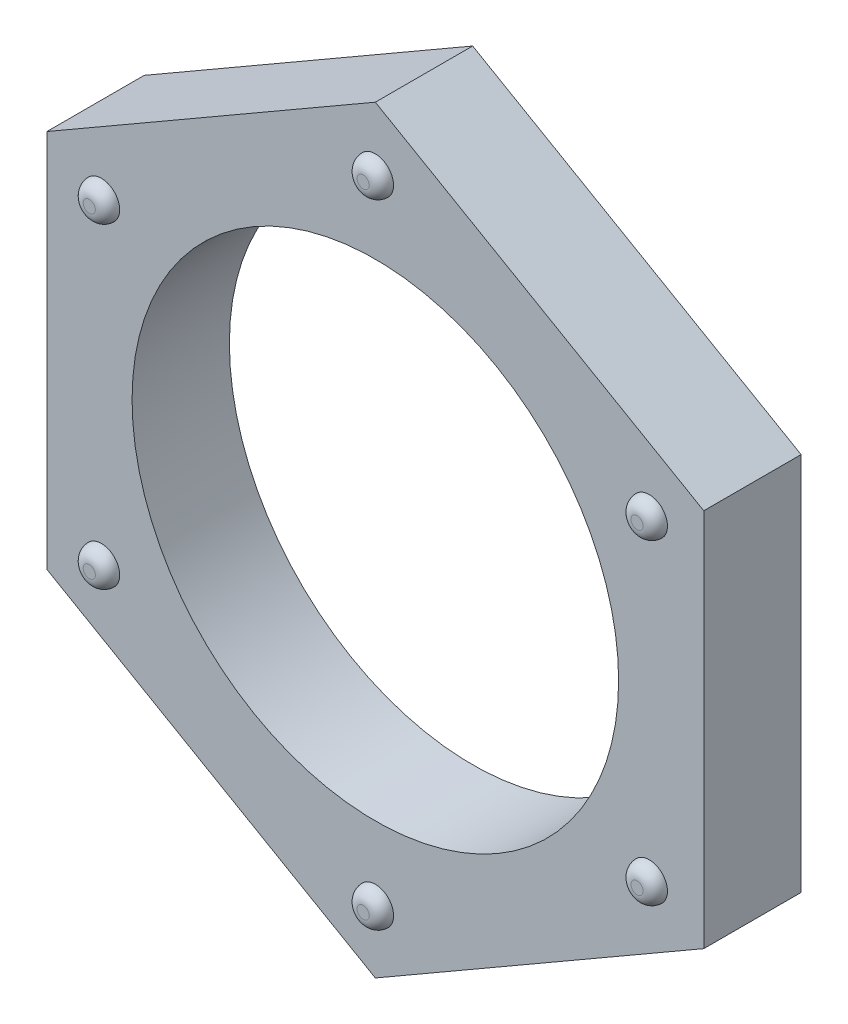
ISO-10303-21;
HEADER;
FILE_DESCRIPTION(('STEP AP214'),'2;1');
FILE_NAME('part.step','',(''),(''),'','','');
FILE_SCHEMA(('AUTOMOTIVE_DESIGN { 1 0 10303 214 1 1 1 1 }'));
ENDSEC;
DATA;
#1=APPLICATION_CONTEXT('core data for automotive mechanical design processes');
#2=APPLICATION_PROTOCOL_DEFINITION('international standard','automotive_design',2000,#1);
#3=PRODUCT_CONTEXT('',#1,'mechanical');
#4=PRODUCT('Part','Part','',(#3));
#5=PRODUCT_RELATED_PRODUCT_CATEGORY('part','',(#4));
#6=PRODUCT_DEFINITION_FORMATION('','',#4);
#7=PRODUCT_DEFINITION_CONTEXT('part definition',#1,'design');
#8=PRODUCT_DEFINITION('design','',#6,#7);
#9=PRODUCT_DEFINITION_SHAPE('','',#8);
#10=(LENGTH_UNIT() NAMED_UNIT(*) SI_UNIT(.MILLI.,.METRE.));
#11=(NAMED_UNIT(*) PLANE_ANGLE_UNIT() SI_UNIT($,.RADIAN.));
#12=(NAMED_UNIT(*) SI_UNIT($,.STERADIAN.) SOLID_ANGLE_UNIT());
#13=UNCERTAINTY_MEASURE_WITH_UNIT(LENGTH_MEASURE(1.E-05),#10,'distance_accuracy_value','');
#14=(GEOMETRIC_REPRESENTATION_CONTEXT(3) GLOBAL_UNCERTAINTY_ASSIGNED_CONTEXT((#13)) GLOBAL_UNIT_ASSIGNED_CONTEXT((#10,
#11,#12)) REPRESENTATION_CONTEXT('',''));
#15=CARTESIAN_POINT('',(0.,0.,0.));
#16=DIRECTION('',(0.,0.,1.));
#17=DIRECTION('',(1.,0.,0.));
#18=AXIS2_PLACEMENT_3D('',#15,#16,#17);
#19=CARTESIAN_POINT('',(0.,15.58845726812,4.));
#20=DIRECTION('',(0.,0.,-1.));
#21=DIRECTION('',(-1.,0.,0.));
#22=AXIS2_PLACEMENT_3D('',#19,#20,#21);
#23=PLANE('',#22);
#24=CARTESIAN_POINT('',(-11.2583302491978,-6.4999999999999,4.));
#25=DIRECTION('',(0.,0.,-1.));
#26=DIRECTION('',(-1.,0.,0.));
#27=AXIS2_PLACEMENT_3D('',#24,#25,#26);
#28=CIRCLE('',#27,0.75);
#29=CARTESIAN_POINT('',(-12.0083302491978,-6.4999999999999,4.));
#30=VERTEX_POINT('',#29);
#31=EDGE_CURVE('E137',#30,#30,#28,.F.);
#32=ORIENTED_EDGE('',*,*,#31,.F.);
#33=EDGE_LOOP('',(#32));
#34=FACE_BOUND('',#33,.T.);
#35=CARTESIAN_POINT('',(11.2583302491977,-6.5,4.));
#36=DIRECTION('',(0.,0.,-1.));
#37=DIRECTION('',(-1.,0.,0.));
#38=AXIS2_PLACEMENT_3D('',#35,#36,#37);
#39=CIRCLE('',#38,0.75);
#40=CARTESIAN_POINT('',(10.5083302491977,-6.5,4.));
#41=VERTEX_POINT('',#40);
#42=EDGE_CURVE('E131',#41,#41,#39,.F.);
#43=ORIENTED_EDGE('',*,*,#42,.F.);
#44=EDGE_LOOP('',(#43));
#45=FACE_BOUND('',#44,.T.);
#46=CARTESIAN_POINT('',(0.,13.,4.));
#47=DIRECTION('',(0.,0.,1.));
#48=DIRECTION('',(1.,0.,0.));
#49=AXIS2_PLACEMENT_3D('',#46,#47,#48);
#50=CIRCLE('',#49,0.75);
#51=CARTESIAN_POINT('',(0.75,13.,4.));
#52=VERTEX_POINT('',#51);
#53=EDGE_CURVE('E78',#52,#52,#50,.T.);
#54=ORIENTED_EDGE('',*,*,#53,.F.);
#55=EDGE_LOOP('',(#54));
#56=FACE_BOUND('',#55,.T.);
#57=DIRECTION('',(-0.866025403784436,0.5,0.));
#58=VECTOR('',#57,1.);
#59=CARTESIAN_POINT('',(13.5,7.79422863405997,4.));
#60=LINE('',#59,#58);
#61=CARTESIAN_POINT('',(13.5,7.79422863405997,4.));
#62=VERTEX_POINT('',#61);
#63=CARTESIAN_POINT('',(0.,15.58845726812,4.));
#64=VERTEX_POINT('',#63);
#65=EDGE_CURVE('E105',#62,#64,#60,.T.);
#66=ORIENTED_EDGE('',*,*,#65,.T.);
#67=DIRECTION('',(0.866025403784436,0.5,0.));
#68=VECTOR('',#67,1.);
#69=CARTESIAN_POINT('',(-13.5,7.79422863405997,4.));
#70=LINE('',#69,#68);
#71=CARTESIAN_POINT('',(-13.5,7.79422863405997,4.));
#72=VERTEX_POINT('',#71);
#73=EDGE_CURVE('E75',#72,#64,#70,.T.);
#74=ORIENTED_EDGE('',*,*,#73,.F.);
#75=DIRECTION('',(0.,-1.,0.));
#76=VECTOR('',#75,1.);
#77=CARTESIAN_POINT('',(-13.5,7.79422863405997,4.));
#78=LINE('',#77,#76);
#79=CARTESIAN_POINT('',(-13.5,-7.79422863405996,4.));
#80=VERTEX_POINT('',#79);
#81=EDGE_CURVE('E108',#72,#80,#78,.T.);
#82=ORIENTED_EDGE('',*,*,#81,.T.);
#83=DIRECTION('',(0.86602540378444,-0.5,0.));
#84=VECTOR('',#83,1.);
#85=CARTESIAN_POINT('',(-13.5,-7.79422863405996,4.));
#86=LINE('',#85,#84);
#87=CARTESIAN_POINT('',(0.,-15.5884572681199,4.));
#88=VERTEX_POINT('',#87);
#89=EDGE_CURVE('E111',#80,#88,#86,.T.);
#90=ORIENTED_EDGE('',*,*,#89,.T.);
#91=DIRECTION('',(-0.86602540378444,-0.5,0.));
#92=VECTOR('',#91,1.);
#93=CARTESIAN_POINT('',(13.5,-7.79422863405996,4.));
#94=LINE('',#93,#92);
#95=CARTESIAN_POINT('',(13.5,-7.79422863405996,4.));
#96=VERTEX_POINT('',#95);
#97=EDGE_CURVE('E114',#96,#88,#94,.T.);
#98=ORIENTED_EDGE('',*,*,#97,.F.);
#99=DIRECTION('',(0.,-1.,0.));
#100=VECTOR('',#99,1.);
#101=CARTESIAN_POINT('',(13.5,7.79422863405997,4.));
#102=LINE('',#101,#100);
#103=EDGE_CURVE('E116',#62,#96,#102,.T.);
#104=ORIENTED_EDGE('',*,*,#103,.F.);
#105=EDGE_LOOP('',(#66,#74,#82,#90,#98,#104));
#106=FACE_BOUND('',#105,.T.);
#107=CARTESIAN_POINT('',(0.,0.,4.));
#108=DIRECTION('',(0.,0.,1.));
#109=DIRECTION('',(1.,0.,0.));
#110=AXIS2_PLACEMENT_3D('',#107,#108,#109);
#111=CIRCLE('',#110,10.);
#112=CARTESIAN_POINT('',(10.,0.,4.));
#113=VERTEX_POINT('',#112);
#114=EDGE_CURVE('E86',#113,#113,#111,.T.);
#115=ORIENTED_EDGE('',*,*,#114,.F.);
#116=EDGE_LOOP('',(#115));
#117=FACE_BOUND('',#116,.T.);
#118=CARTESIAN_POINT('',(11.2583302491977,6.5,4.));
#119=DIRECTION('',(0.,0.,-1.));
#120=DIRECTION('',(-1.,0.,0.));
#121=AXIS2_PLACEMENT_3D('',#118,#119,#120);
#122=CIRCLE('',#121,0.75);
#123=CARTESIAN_POINT('',(10.5083302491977,6.5,4.));
#124=VERTEX_POINT('',#123);
#125=EDGE_CURVE('E128',#124,#124,#122,.F.);
#126=ORIENTED_EDGE('',*,*,#125,.F.);
#127=EDGE_LOOP('',(#126));
#128=FACE_BOUND('',#127,.T.);
#129=CARTESIAN_POINT('',(0.,-13.,4.));
#130=DIRECTION('',(0.,0.,-1.));
#131=DIRECTION('',(-1.,0.,0.));
#132=AXIS2_PLACEMENT_3D('',#129,#130,#131);
#133=CIRCLE('',#132,0.75);
#134=CARTESIAN_POINT('',(-0.750000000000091,-13.,4.));
#135=VERTEX_POINT('',#134);
#136=EDGE_CURVE('E134',#135,#135,#133,.F.);
#137=ORIENTED_EDGE('',*,*,#136,.F.);
#138=EDGE_LOOP('',(#137));
#139=FACE_BOUND('',#138,.T.);
#140=CARTESIAN_POINT('',(-11.2583302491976,6.50000000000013,4.));
#141=DIRECTION('',(0.,0.,-1.));
#142=DIRECTION('',(-1.,0.,0.));
#143=AXIS2_PLACEMENT_3D('',#140,#141,#142);
#144=CIRCLE('',#143,0.75);
#145=CARTESIAN_POINT('',(-12.0083302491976,6.50000000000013,4.));
#146=VERTEX_POINT('',#145);
#147=EDGE_CURVE('E140',#146,#146,#144,.F.);
#148=ORIENTED_EDGE('',*,*,#147,.F.);
#149=EDGE_LOOP('',(#148));
#150=FACE_BOUND('',#149,.T.);
#151=ADVANCED_FACE('F14',(#34,#45,#56,#106,#117,#128,#139,#150),#23,.F.);
#152=CARTESIAN_POINT('',(0.,15.58845726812,0.));
#153=DIRECTION('',(0.,0.,-1.));
#154=DIRECTION('',(-1.,0.,0.));
#155=AXIS2_PLACEMENT_3D('',#152,#153,#154);
#156=PLANE('',#155);
#157=DIRECTION('',(-0.866025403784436,0.5,0.));
#158=VECTOR('',#157,1.);
#159=CARTESIAN_POINT('',(13.5,7.79422863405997,0.));
#160=LINE('',#159,#158);
#161=CARTESIAN_POINT('',(13.5,7.79422863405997,0.));
#162=VERTEX_POINT('',#161);
#163=CARTESIAN_POINT('',(0.,15.58845726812,0.));
#164=VERTEX_POINT('',#163);
#165=EDGE_CURVE('E82',#162,#164,#160,.T.);
#166=ORIENTED_EDGE('',*,*,#165,.F.);
#167=DIRECTION('',(0.,-1.,0.));
#168=VECTOR('',#167,1.);
#169=CARTESIAN_POINT('',(13.5,7.79422863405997,0.));
#170=LINE('',#169,#168);
#171=CARTESIAN_POINT('',(13.5,-7.79422863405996,0.));
#172=VERTEX_POINT('',#171);
#173=EDGE_CURVE('E103',#162,#172,#170,.T.);
#174=ORIENTED_EDGE('',*,*,#173,.T.);
#175=DIRECTION('',(-0.86602540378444,-0.5,0.));
#176=VECTOR('',#175,1.);
#177=CARTESIAN_POINT('',(13.5,-7.79422863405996,0.));
#178=LINE('',#177,#176);
#179=CARTESIAN_POINT('',(0.,-15.5884572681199,0.));
#180=VERTEX_POINT('',#179);
#181=EDGE_CURVE('E100',#172,#180,#178,.T.);
#182=ORIENTED_EDGE('',*,*,#181,.T.);
#183=DIRECTION('',(0.86602540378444,-0.5,0.));
#184=VECTOR('',#183,1.);
#185=CARTESIAN_POINT('',(-13.5,-7.79422863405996,0.));
#186=LINE('',#185,#184);
#187=CARTESIAN_POINT('',(-13.5,-7.79422863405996,0.));
#188=VERTEX_POINT('',#187);
#189=EDGE_CURVE('E94',#188,#180,#186,.T.);
#190=ORIENTED_EDGE('',*,*,#189,.F.);
#191=DIRECTION('',(0.,-1.,0.));
#192=VECTOR('',#191,1.);
#193=CARTESIAN_POINT('',(-13.5,7.79422863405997,0.));
#194=LINE('',#193,#192);
#195=CARTESIAN_POINT('',(-13.5,7.79422863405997,0.));
#196=VERTEX_POINT('',#195);
#197=EDGE_CURVE('E92',#196,#188,#194,.T.);
#198=ORIENTED_EDGE('',*,*,#197,.F.);
#199=DIRECTION('',(0.866025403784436,0.5,0.));
#200=VECTOR('',#199,1.);
#201=CARTESIAN_POINT('',(-13.5,7.79422863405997,0.));
#202=LINE('',#201,#200);
#203=EDGE_CURVE('E72',#196,#164,#202,.T.);
#204=ORIENTED_EDGE('',*,*,#203,.T.);
#205=EDGE_LOOP('',(#166,#174,#182,#190,#198,#204));
#206=FACE_BOUND('',#205,.T.);
#207=CARTESIAN_POINT('',(0.,0.,0.));
#208=DIRECTION('',(0.,0.,1.));
#209=DIRECTION('',(1.,0.,0.));
#210=AXIS2_PLACEMENT_3D('',#207,#208,#209);
#211=CIRCLE('',#210,10.);
#212=CARTESIAN_POINT('',(10.,0.,0.));
#213=VERTEX_POINT('',#212);
#214=EDGE_CURVE('E261',#213,#213,#211,.T.);
#215=ORIENTED_EDGE('',*,*,#214,.T.);
#216=EDGE_LOOP('',(#215));
#217=FACE_BOUND('',#216,.T.);
#218=ADVANCED_FACE('F88',(#206,#217),#156,.T.);
#219=CARTESIAN_POINT('',(13.5,7.79422863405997,4.));
#220=DIRECTION('',(-0.5,-0.866025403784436,0.));
#221=DIRECTION('',(0.866025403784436,-0.5,0.));
#222=AXIS2_PLACEMENT_3D('',#219,#220,#221);
#223=PLANE('',#222);
#224=DIRECTION('',(0.,0.,-1.));
#225=VECTOR('',#224,1.);
#226=CARTESIAN_POINT('',(0.,15.58845726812,4.));
#227=LINE('',#226,#225);
#228=EDGE_CURVE('E69',#64,#164,#227,.T.);
#229=ORIENTED_EDGE('',*,*,#228,.F.);
#230=ORIENTED_EDGE('',*,*,#65,.F.);
#231=DIRECTION('',(0.,0.,-1.));
#232=VECTOR('',#231,1.);
#233=CARTESIAN_POINT('',(13.5,7.79422863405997,4.));
#234=LINE('',#233,#232);
#235=EDGE_CURVE('E29',#62,#162,#234,.T.);
#236=ORIENTED_EDGE('',*,*,#235,.T.);
#237=ORIENTED_EDGE('',*,*,#165,.T.);
#238=EDGE_LOOP('',(#229,#230,#236,#237));
#239=FACE_BOUND('',#238,.T.);
#240=ADVANCED_FACE('F83',(#239),#223,.F.);
#241=CARTESIAN_POINT('',(-13.5,7.79422863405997,4.));
#242=DIRECTION('',(-0.5,0.866025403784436,0.));
#243=DIRECTION('',(-0.866025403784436,-0.5,0.));
#244=AXIS2_PLACEMENT_3D('',#241,#242,#243);
#245=PLANE('',#244);
#246=DIRECTION('',(0.,0.,-1.));
#247=VECTOR('',#246,1.);
#248=CARTESIAN_POINT('',(-13.5,7.79422863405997,4.));
#249=LINE('',#248,#247);
#250=EDGE_CURVE('E79',#72,#196,#249,.T.);
#251=ORIENTED_EDGE('',*,*,#250,.F.);
#252=ORIENTED_EDGE('',*,*,#73,.T.);
#253=ORIENTED_EDGE('',*,*,#228,.T.);
#254=ORIENTED_EDGE('',*,*,#203,.F.);
#255=EDGE_LOOP('',(#251,#252,#253,#254));
#256=FACE_BOUND('',#255,.T.);
#257=ADVANCED_FACE('F16',(#256),#245,.T.);
#258=CARTESIAN_POINT('',(-13.5,7.79422863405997,4.));
#259=DIRECTION('',(1.,0.,0.));
#260=DIRECTION('',(0.,1.,0.));
#261=AXIS2_PLACEMENT_3D('',#258,#259,#260);
#262=PLANE('',#261);
#263=DIRECTION('',(0.,0.,-1.));
#264=VECTOR('',#263,1.);
#265=CARTESIAN_POINT('',(-13.5,-7.79422863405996,4.));
#266=LINE('',#265,#264);
#267=EDGE_CURVE('E122',#80,#188,#266,.T.);
#268=ORIENTED_EDGE('',*,*,#267,.F.);
#269=ORIENTED_EDGE('',*,*,#81,.F.);
#270=ORIENTED_EDGE('',*,*,#250,.T.);
#271=ORIENTED_EDGE('',*,*,#197,.T.);
#272=EDGE_LOOP('',(#268,#269,#270,#271));
#273=FACE_BOUND('',#272,.T.);
#274=ADVANCED_FACE('F196',(#273),#262,.F.);
#275=CARTESIAN_POINT('',(-13.5,-7.79422863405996,4.));
#276=DIRECTION('',(0.5,0.86602540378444,0.));
#277=DIRECTION('',(-0.86602540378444,0.5,0.));
#278=AXIS2_PLACEMENT_3D('',#275,#276,#277);
#279=PLANE('',#278);
#280=DIRECTION('',(0.,0.,-1.));
#281=VECTOR('',#280,1.);
#282=CARTESIAN_POINT('',(0.,-15.5884572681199,4.));
#283=LINE('',#282,#281);
#284=EDGE_CURVE('E120',#88,#180,#283,.T.);
#285=ORIENTED_EDGE('',*,*,#284,.F.);
#286=ORIENTED_EDGE('',*,*,#89,.F.);
#287=ORIENTED_EDGE('',*,*,#267,.T.);
#288=ORIENTED_EDGE('',*,*,#189,.T.);
#289=EDGE_LOOP('',(#285,#286,#287,#288));
#290=FACE_BOUND('',#289,.T.);
#291=ADVANCED_FACE('F194',(#290),#279,.F.);
#292=CARTESIAN_POINT('',(13.5,-7.79422863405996,4.));
#293=DIRECTION('',(0.5,-0.86602540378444,0.));
#294=DIRECTION('',(0.86602540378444,0.5,0.));
#295=AXIS2_PLACEMENT_3D('',#292,#293,#294);
#296=PLANE('',#295);
#297=DIRECTION('',(0.,0.,-1.));
#298=VECTOR('',#297,1.);
#299=CARTESIAN_POINT('',(13.5,-7.79422863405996,4.));
#300=LINE('',#299,#298);
#301=EDGE_CURVE('E37',#96,#172,#300,.T.);
#302=ORIENTED_EDGE('',*,*,#301,.F.);
#303=ORIENTED_EDGE('',*,*,#97,.T.);
#304=ORIENTED_EDGE('',*,*,#284,.T.);
#305=ORIENTED_EDGE('',*,*,#181,.F.);
#306=EDGE_LOOP('',(#302,#303,#304,#305));
#307=FACE_BOUND('',#306,.T.);
#308=ADVANCED_FACE('F191',(#307),#296,.T.);
#309=CARTESIAN_POINT('',(13.5,7.79422863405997,4.));
#310=DIRECTION('',(1.,0.,0.));
#311=DIRECTION('',(0.,1.,0.));
#312=AXIS2_PLACEMENT_3D('',#309,#310,#311);
#313=PLANE('',#312);
#314=ORIENTED_EDGE('',*,*,#103,.T.);
#315=ORIENTED_EDGE('',*,*,#301,.T.);
#316=ORIENTED_EDGE('',*,*,#173,.F.);
#317=ORIENTED_EDGE('',*,*,#235,.F.);
#318=EDGE_LOOP('',(#314,#315,#316,#317));
#319=FACE_BOUND('',#318,.T.);
#320=ADVANCED_FACE('F187',(#319),#313,.T.);
#321=CARTESIAN_POINT('',(0.,0.,4.));
#322=DIRECTION('',(0.,0.,-1.));
#323=DIRECTION('',(-1.,0.,0.));
#324=AXIS2_PLACEMENT_3D('',#321,#322,#323);
#325=CYLINDRICAL_SURFACE('',#324,10.);
#326=ORIENTED_EDGE('',*,*,#114,.T.);
#327=EDGE_LOOP('',(#326));
#328=FACE_BOUND('',#327,.T.);
#329=ORIENTED_EDGE('',*,*,#214,.F.);
#330=EDGE_LOOP('',(#329));
#331=FACE_BOUND('',#330,.T.);
#332=ADVANCED_FACE('F190',(#328,#331),#325,.F.);
#333=CARTESIAN_POINT('',(0.,13.,4.5));
#334=DIRECTION('',(0.,0.,1.));
#335=DIRECTION('',(1.,0.,0.));
#336=AXIS2_PLACEMENT_3D('',#333,#334,#335);
#337=PLANE('',#336);
#338=CARTESIAN_POINT('',(0.,13.,4.5));
#339=DIRECTION('',(0.,0.,1.));
#340=DIRECTION('',(1.,0.,0.));
#341=AXIS2_PLACEMENT_3D('',#338,#339,#340);
#342=CIRCLE('',#341,0.25);
#343=CARTESIAN_POINT('',(0.25,13.,4.5));
#344=VERTEX_POINT('',#343);
#345=EDGE_CURVE('E125',#344,#344,#342,.T.);
#346=ORIENTED_EDGE('',*,*,#345,.T.);
#347=EDGE_LOOP('',(#346));
#348=FACE_BOUND('',#347,.T.);
#349=ADVANCED_FACE('F249',(#348),#337,.T.);
#350=CARTESIAN_POINT('',(0.,13.,4.));
#351=DIRECTION('',(0.,0.,1.));
#352=DIRECTION('',(1.,0.,0.));
#353=AXIS2_PLACEMENT_3D('',#350,#351,#352);
#354=DEGENERATE_TOROIDAL_SURFACE('',#353,0.25,0.5,.T.);
#355=ORIENTED_EDGE('',*,*,#53,.T.);
#356=EDGE_LOOP('',(#355));
#357=FACE_BOUND('',#356,.T.);
#358=ORIENTED_EDGE('',*,*,#345,.F.);
#359=EDGE_LOOP('',(#358));
#360=FACE_BOUND('',#359,.T.);
#361=ADVANCED_FACE('F245',(#357,#360),#354,.T.);
#362=CARTESIAN_POINT('',(11.2583302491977,6.5,4.5));
#363=DIRECTION('',(0.,0.,1.));
#364=DIRECTION('',(0.5,-0.86602540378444,0.));
#365=AXIS2_PLACEMENT_3D('',#362,#363,#364);
#366=PLANE('',#365);
#367=CARTESIAN_POINT('',(11.2583302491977,6.5,4.5));
#368=DIRECTION('',(0.,0.,1.));
#369=DIRECTION('',(1.,0.,0.));
#370=AXIS2_PLACEMENT_3D('',#367,#368,#369);
#371=CIRCLE('',#370,0.25);
#372=CARTESIAN_POINT('',(11.5083302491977,6.5,4.5));
#373=VERTEX_POINT('',#372);
#374=EDGE_CURVE('E143',#373,#373,#371,.T.);
#375=ORIENTED_EDGE('',*,*,#374,.T.);
#376=EDGE_LOOP('',(#375));
#377=FACE_BOUND('',#376,.T.);
#378=ADVANCED_FACE('F241',(#377),#366,.T.);
#379=CARTESIAN_POINT('',(11.2583302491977,-6.5,4.5));
#380=DIRECTION('',(0.,0.,1.));
#381=DIRECTION('',(-0.5,-0.866025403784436,0.));
#382=AXIS2_PLACEMENT_3D('',#379,#380,#381);
#383=PLANE('',#382);
#384=CARTESIAN_POINT('',(11.2583302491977,-6.5,4.5));
#385=DIRECTION('',(0.,0.,1.));
#386=DIRECTION('',(1.,0.,0.));
#387=AXIS2_PLACEMENT_3D('',#384,#385,#386);
#388=CIRCLE('',#387,0.25);
#389=CARTESIAN_POINT('',(11.5083302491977,-6.5,4.5));
#390=VERTEX_POINT('',#389);
#391=EDGE_CURVE('E146',#390,#390,#388,.T.);
#392=ORIENTED_EDGE('',*,*,#391,.T.);
#393=EDGE_LOOP('',(#392));
#394=FACE_BOUND('',#393,.T.);
#395=ADVANCED_FACE('F237',(#394),#383,.T.);
#396=CARTESIAN_POINT('',(0.,-13.,4.5));
#397=DIRECTION('',(0.,0.,1.));
#398=DIRECTION('',(-1.,0.,0.));
#399=AXIS2_PLACEMENT_3D('',#396,#397,#398);
#400=PLANE('',#399);
#401=CARTESIAN_POINT('',(0.,-13.,4.5));
#402=DIRECTION('',(0.,0.,1.));
#403=DIRECTION('',(1.,0.,0.));
#404=AXIS2_PLACEMENT_3D('',#401,#402,#403);
#405=CIRCLE('',#404,0.25);
#406=CARTESIAN_POINT('',(0.249999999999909,-13.,4.5));
#407=VERTEX_POINT('',#406);
#408=EDGE_CURVE('E149',#407,#407,#405,.T.);
#409=ORIENTED_EDGE('',*,*,#408,.T.);
#410=EDGE_LOOP('',(#409));
#411=FACE_BOUND('',#410,.T.);
#412=ADVANCED_FACE('F231',(#411),#400,.T.);
#413=CARTESIAN_POINT('',(-11.2583302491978,-6.4999999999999,4.5));
#414=DIRECTION('',(0.,0.,1.));
#415=DIRECTION('',(-0.499999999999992,0.866025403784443,0.));
#416=AXIS2_PLACEMENT_3D('',#413,#414,#415);
#417=PLANE('',#416);
#418=CARTESIAN_POINT('',(-11.2583302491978,-6.4999999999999,4.5));
#419=DIRECTION('',(0.,0.,1.));
#420=DIRECTION('',(1.,0.,0.));
#421=AXIS2_PLACEMENT_3D('',#418,#419,#420);
#422=CIRCLE('',#421,0.25);
#423=CARTESIAN_POINT('',(-11.0083302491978,-6.4999999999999,4.5));
#424=VERTEX_POINT('',#423);
#425=EDGE_CURVE('E22',#424,#424,#422,.T.);
#426=ORIENTED_EDGE('',*,*,#425,.T.);
#427=EDGE_LOOP('',(#426));
#428=FACE_BOUND('',#427,.T.);
#429=ADVANCED_FACE('F154',(#428),#417,.T.);
#430=CARTESIAN_POINT('',(-11.2583302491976,6.50000000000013,4.5));
#431=DIRECTION('',(0.,0.,1.));
#432=DIRECTION('',(0.50000000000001,0.866025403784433,0.));
#433=AXIS2_PLACEMENT_3D('',#430,#431,#432);
#434=PLANE('',#433);
#435=CARTESIAN_POINT('',(-11.2583302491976,6.50000000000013,4.5));
#436=DIRECTION('',(0.,0.,1.));
#437=DIRECTION('',(1.,0.,0.));
#438=AXIS2_PLACEMENT_3D('',#435,#436,#437);
#439=CIRCLE('',#438,0.25);
#440=CARTESIAN_POINT('',(-11.0083302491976,6.50000000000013,4.5));
#441=VERTEX_POINT('',#440);
#442=EDGE_CURVE('E9',#441,#441,#439,.T.);
#443=ORIENTED_EDGE('',*,*,#442,.T.);
#444=EDGE_LOOP('',(#443));
#445=FACE_BOUND('',#444,.T.);
#446=ADVANCED_FACE('F220',(#445),#434,.T.);
#447=CARTESIAN_POINT('',(11.2583302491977,6.5,4.));
#448=DIRECTION('',(0.,0.,1.));
#449=DIRECTION('',(1.,0.,0.));
#450=AXIS2_PLACEMENT_3D('',#447,#448,#449);
#451=DEGENERATE_TOROIDAL_SURFACE('',#450,0.25,0.5,.T.);
#452=ORIENTED_EDGE('',*,*,#125,.T.);
#453=EDGE_LOOP('',(#452));
#454=FACE_BOUND('',#453,.T.);
#455=ORIENTED_EDGE('',*,*,#374,.F.);
#456=EDGE_LOOP('',(#455));
#457=FACE_BOUND('',#456,.T.);
#458=ADVANCED_FACE('F222',(#454,#457),#451,.T.);
#459=CARTESIAN_POINT('',(11.2583302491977,-6.5,4.));
#460=DIRECTION('',(0.,0.,1.));
#461=DIRECTION('',(1.,0.,0.));
#462=AXIS2_PLACEMENT_3D('',#459,#460,#461);
#463=DEGENERATE_TOROIDAL_SURFACE('',#462,0.25,0.5,.T.);
#464=ORIENTED_EDGE('',*,*,#42,.T.);
#465=EDGE_LOOP('',(#464));
#466=FACE_BOUND('',#465,.T.);
#467=ORIENTED_EDGE('',*,*,#391,.F.);
#468=EDGE_LOOP('',(#467));
#469=FACE_BOUND('',#468,.T.);
#470=ADVANCED_FACE('F170',(#466,#469),#463,.T.);
#471=CARTESIAN_POINT('',(0.,-13.,4.));
#472=DIRECTION('',(0.,0.,1.));
#473=DIRECTION('',(1.,0.,0.));
#474=AXIS2_PLACEMENT_3D('',#471,#472,#473);
#475=DEGENERATE_TOROIDAL_SURFACE('',#474,0.25,0.5,.T.);
#476=ORIENTED_EDGE('',*,*,#136,.T.);
#477=EDGE_LOOP('',(#476));
#478=FACE_BOUND('',#477,.T.);
#479=ORIENTED_EDGE('',*,*,#408,.F.);
#480=EDGE_LOOP('',(#479));
#481=FACE_BOUND('',#480,.T.);
#482=ADVANCED_FACE('F159',(#478,#481),#475,.T.);
#483=CARTESIAN_POINT('',(-11.2583302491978,-6.4999999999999,4.));
#484=DIRECTION('',(0.,0.,1.));
#485=DIRECTION('',(1.,0.,0.));
#486=AXIS2_PLACEMENT_3D('',#483,#484,#485);
#487=DEGENERATE_TOROIDAL_SURFACE('',#486,0.25,0.5,.T.);
#488=ORIENTED_EDGE('',*,*,#31,.T.);
#489=EDGE_LOOP('',(#488));
#490=FACE_BOUND('',#489,.T.);
#491=ORIENTED_EDGE('',*,*,#425,.F.);
#492=EDGE_LOOP('',(#491));
#493=FACE_BOUND('',#492,.T.);
#494=ADVANCED_FACE('F156',(#490,#493),#487,.T.);
#495=CARTESIAN_POINT('',(-11.2583302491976,6.50000000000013,4.));
#496=DIRECTION('',(0.,0.,1.));
#497=DIRECTION('',(1.,0.,0.));
#498=AXIS2_PLACEMENT_3D('',#495,#496,#497);
#499=DEGENERATE_TOROIDAL_SURFACE('',#498,0.25,0.5,.T.);
#500=ORIENTED_EDGE('',*,*,#147,.T.);
#501=EDGE_LOOP('',(#500));
#502=FACE_BOUND('',#501,.T.);
#503=ORIENTED_EDGE('',*,*,#442,.F.);
#504=EDGE_LOOP('',(#503));
#505=FACE_BOUND('',#504,.T.);
#506=ADVANCED_FACE('F158',(#502,#505),#499,.T.);
#507=CLOSED_SHELL('',(#151,#218,#240,#257,#274,#291,#308,#320,#332,#349,#361,#378,#395,#412,
#429,#446,#458,#470,#482,#494,#506));
#508=MANIFOLD_SOLID_BREP('B1',#507);
#509=ADVANCED_BREP_SHAPE_REPRESENTATION('',(#18,#508),#14);
#510=SHAPE_DEFINITION_REPRESENTATION(#9,#509);
ENDSEC;
END-ISO-10303-21;
